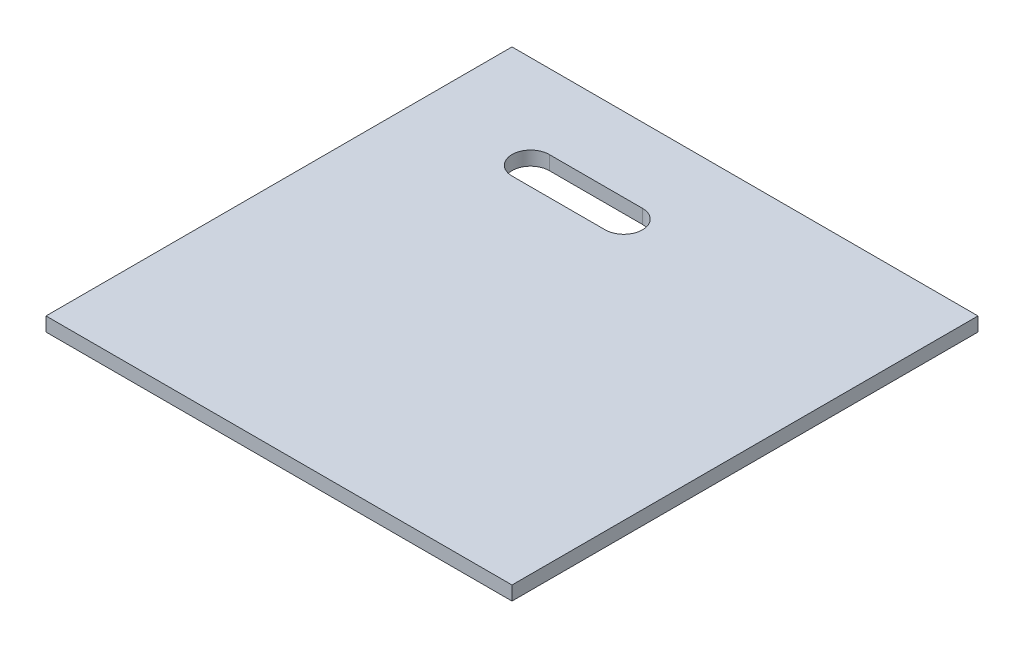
ISO-10303-21;
HEADER;
FILE_DESCRIPTION(('STEP AP214'),'2;1');
FILE_NAME('part.step','',(''),(''),'','','');
FILE_SCHEMA(('AUTOMOTIVE_DESIGN { 1 0 10303 214 1 1 1 1 }'));
ENDSEC;
DATA;
#1=APPLICATION_CONTEXT('core data for automotive mechanical design processes');
#2=APPLICATION_PROTOCOL_DEFINITION('international standard','automotive_design',2000,#1);
#3=PRODUCT_CONTEXT('',#1,'mechanical');
#4=PRODUCT('Part','Part','',(#3));
#5=PRODUCT_RELATED_PRODUCT_CATEGORY('part','',(#4));
#6=PRODUCT_DEFINITION_FORMATION('','',#4);
#7=PRODUCT_DEFINITION_CONTEXT('part definition',#1,'design');
#8=PRODUCT_DEFINITION('design','',#6,#7);
#9=PRODUCT_DEFINITION_SHAPE('','',#8);
#10=(LENGTH_UNIT() NAMED_UNIT(*) SI_UNIT(.MILLI.,.METRE.));
#11=(NAMED_UNIT(*) PLANE_ANGLE_UNIT() SI_UNIT($,.RADIAN.));
#12=(NAMED_UNIT(*) SI_UNIT($,.STERADIAN.) SOLID_ANGLE_UNIT());
#13=UNCERTAINTY_MEASURE_WITH_UNIT(LENGTH_MEASURE(1.E-05),#10,'distance_accuracy_value','');
#14=(GEOMETRIC_REPRESENTATION_CONTEXT(3) GLOBAL_UNCERTAINTY_ASSIGNED_CONTEXT((#13)) GLOBAL_UNIT_ASSIGNED_CONTEXT((#10,
#11,#12)) REPRESENTATION_CONTEXT('',''));
#15=CARTESIAN_POINT('',(0.,0.,0.));
#16=DIRECTION('',(0.,0.,1.));
#17=DIRECTION('',(1.,0.,0.));
#18=AXIS2_PLACEMENT_3D('',#15,#16,#17);
#19=CARTESIAN_POINT('',(250.,15.,250.));
#20=DIRECTION('',(-1.,0.,0.));
#21=DIRECTION('',(0.,0.,1.));
#22=AXIS2_PLACEMENT_3D('',#19,#20,#21);
#23=PLANE('',#22);
#24=DIRECTION('',(0.,0.,-1.));
#25=VECTOR('',#24,1.);
#26=CARTESIAN_POINT('',(250.,0.,250.));
#27=LINE('',#26,#25);
#28=CARTESIAN_POINT('',(250.,0.,250.));
#29=VERTEX_POINT('',#28);
#30=CARTESIAN_POINT('',(250.,0.,-250.));
#31=VERTEX_POINT('',#30);
#32=EDGE_CURVE('E128',#29,#31,#27,.T.);
#33=ORIENTED_EDGE('',*,*,#32,.T.);
#34=DIRECTION('',(0.,-1.,0.));
#35=VECTOR('',#34,1.);
#36=CARTESIAN_POINT('',(250.,15.,-250.));
#37=LINE('',#36,#35);
#38=CARTESIAN_POINT('',(250.,15.,-250.));
#39=VERTEX_POINT('',#38);
#40=EDGE_CURVE('E11',#39,#31,#37,.T.);
#41=ORIENTED_EDGE('',*,*,#40,.F.);
#42=DIRECTION('',(0.,0.,-1.));
#43=VECTOR('',#42,1.);
#44=CARTESIAN_POINT('',(250.,15.,250.));
#45=LINE('',#44,#43);
#46=CARTESIAN_POINT('',(250.,15.,250.));
#47=VERTEX_POINT('',#46);
#48=EDGE_CURVE('E132',#47,#39,#45,.T.);
#49=ORIENTED_EDGE('',*,*,#48,.F.);
#50=DIRECTION('',(0.,-1.,0.));
#51=VECTOR('',#50,1.);
#52=CARTESIAN_POINT('',(250.,15.,250.));
#53=LINE('',#52,#51);
#54=EDGE_CURVE('E142',#47,#29,#53,.T.);
#55=ORIENTED_EDGE('',*,*,#54,.T.);
#56=EDGE_LOOP('',(#33,#41,#49,#55));
#57=FACE_BOUND('',#56,.T.);
#58=ADVANCED_FACE('F31',(#57),#23,.F.);
#59=CARTESIAN_POINT('',(-250.,15.,-250.));
#60=DIRECTION('',(0.,0.,1.));
#61=DIRECTION('',(1.,0.,0.));
#62=AXIS2_PLACEMENT_3D('',#59,#60,#61);
#63=PLANE('',#62);
#64=DIRECTION('',(-1.,0.,0.));
#65=VECTOR('',#64,1.);
#66=CARTESIAN_POINT('',(-250.,0.,-250.));
#67=LINE('',#66,#65);
#68=CARTESIAN_POINT('',(-250.,0.,-250.));
#69=VERTEX_POINT('',#68);
#70=EDGE_CURVE('E145',#31,#69,#67,.T.);
#71=ORIENTED_EDGE('',*,*,#70,.T.);
#72=DIRECTION('',(0.,-1.,0.));
#73=VECTOR('',#72,1.);
#74=CARTESIAN_POINT('',(-250.,15.,-250.));
#75=LINE('',#74,#73);
#76=CARTESIAN_POINT('',(-250.,15.,-250.));
#77=VERTEX_POINT('',#76);
#78=EDGE_CURVE('E38',#77,#69,#75,.T.);
#79=ORIENTED_EDGE('',*,*,#78,.F.);
#80=DIRECTION('',(-1.,0.,0.));
#81=VECTOR('',#80,1.);
#82=CARTESIAN_POINT('',(-250.,15.,-250.));
#83=LINE('',#82,#81);
#84=EDGE_CURVE('E135',#39,#77,#83,.T.);
#85=ORIENTED_EDGE('',*,*,#84,.F.);
#86=ORIENTED_EDGE('',*,*,#40,.T.);
#87=EDGE_LOOP('',(#71,#79,#85,#86));
#88=FACE_BOUND('',#87,.T.);
#89=ADVANCED_FACE('F173',(#88),#63,.F.);
#90=CARTESIAN_POINT('',(-250.,15.,250.));
#91=DIRECTION('',(1.,0.,0.));
#92=DIRECTION('',(0.,0.,-1.));
#93=AXIS2_PLACEMENT_3D('',#90,#91,#92);
#94=PLANE('',#93);
#95=DIRECTION('',(0.,0.,1.));
#96=VECTOR('',#95,1.);
#97=CARTESIAN_POINT('',(-250.,0.,250.));
#98=LINE('',#97,#96);
#99=CARTESIAN_POINT('',(-250.,0.,250.));
#100=VERTEX_POINT('',#99);
#101=EDGE_CURVE('E147',#69,#100,#98,.T.);
#102=ORIENTED_EDGE('',*,*,#101,.T.);
#103=DIRECTION('',(0.,-1.,0.));
#104=VECTOR('',#103,1.);
#105=CARTESIAN_POINT('',(-250.,15.,250.));
#106=LINE('',#105,#104);
#107=CARTESIAN_POINT('',(-250.,15.,250.));
#108=VERTEX_POINT('',#107);
#109=EDGE_CURVE('E152',#108,#100,#106,.T.);
#110=ORIENTED_EDGE('',*,*,#109,.F.);
#111=DIRECTION('',(0.,0.,1.));
#112=VECTOR('',#111,1.);
#113=CARTESIAN_POINT('',(-250.,15.,250.));
#114=LINE('',#113,#112);
#115=EDGE_CURVE('E138',#77,#108,#114,.T.);
#116=ORIENTED_EDGE('',*,*,#115,.F.);
#117=ORIENTED_EDGE('',*,*,#78,.T.);
#118=EDGE_LOOP('',(#102,#110,#116,#117));
#119=FACE_BOUND('',#118,.T.);
#120=ADVANCED_FACE('F159',(#119),#94,.F.);
#121=CARTESIAN_POINT('',(-250.,15.,250.));
#122=DIRECTION('',(0.,0.,-1.));
#123=DIRECTION('',(-1.,0.,0.));
#124=AXIS2_PLACEMENT_3D('',#121,#122,#123);
#125=PLANE('',#124);
#126=DIRECTION('',(1.,0.,0.));
#127=VECTOR('',#126,1.);
#128=CARTESIAN_POINT('',(-250.,0.,250.));
#129=LINE('',#128,#127);
#130=EDGE_CURVE('E136',#100,#29,#129,.T.);
#131=ORIENTED_EDGE('',*,*,#130,.T.);
#132=ORIENTED_EDGE('',*,*,#54,.F.);
#133=DIRECTION('',(1.,0.,0.));
#134=VECTOR('',#133,1.);
#135=CARTESIAN_POINT('',(-250.,15.,250.));
#136=LINE('',#135,#134);
#137=EDGE_CURVE('E140',#108,#47,#136,.T.);
#138=ORIENTED_EDGE('',*,*,#137,.F.);
#139=ORIENTED_EDGE('',*,*,#109,.T.);
#140=EDGE_LOOP('',(#131,#132,#138,#139));
#141=FACE_BOUND('',#140,.T.);
#142=ADVANCED_FACE('F166',(#141),#125,.F.);
#143=CARTESIAN_POINT('',(250.,15.,-250.));
#144=DIRECTION('',(0.,-1.,0.));
#145=DIRECTION('',(0.,0.,-1.));
#146=AXIS2_PLACEMENT_3D('',#143,#144,#145);
#147=PLANE('',#146);
#148=DIRECTION('',(1.,0.,0.));
#149=VECTOR('',#148,1.);
#150=CARTESIAN_POINT('',(-130.,15.,-130.));
#151=LINE('',#150,#149);
#152=CARTESIAN_POINT('',(-130.,15.,-130.));
#153=VERTEX_POINT('',#152);
#154=CARTESIAN_POINT('',(-30.0000000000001,15.,-130.));
#155=VERTEX_POINT('',#154);
#156=EDGE_CURVE('E122',#153,#155,#151,.T.);
#157=ORIENTED_EDGE('',*,*,#156,.F.);
#158=CARTESIAN_POINT('',(-130.,15.,-150.));
#159=DIRECTION('',(0.,1.,0.));
#160=DIRECTION('',(0.,0.,-1.));
#161=AXIS2_PLACEMENT_3D('',#158,#159,#160);
#162=CIRCLE('',#161,20.);
#163=CARTESIAN_POINT('',(-130.,15.,-170.));
#164=VERTEX_POINT('',#163);
#165=EDGE_CURVE('E45',#164,#153,#162,.T.);
#166=ORIENTED_EDGE('',*,*,#165,.F.);
#167=DIRECTION('',(-1.,0.,0.));
#168=VECTOR('',#167,1.);
#169=CARTESIAN_POINT('',(-130.,15.,-170.));
#170=LINE('',#169,#168);
#171=CARTESIAN_POINT('',(-30.,15.,-170.));
#172=VERTEX_POINT('',#171);
#173=EDGE_CURVE('E113',#172,#164,#170,.T.);
#174=ORIENTED_EDGE('',*,*,#173,.F.);
#175=CARTESIAN_POINT('',(-30.0000000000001,15.,-150.));
#176=DIRECTION('',(0.,1.,0.));
#177=DIRECTION('',(0.,0.,1.));
#178=AXIS2_PLACEMENT_3D('',#175,#176,#177);
#179=CIRCLE('',#178,20.);
#180=EDGE_CURVE('E116',#155,#172,#179,.T.);
#181=ORIENTED_EDGE('',*,*,#180,.F.);
#182=EDGE_LOOP('',(#157,#166,#174,#181));
#183=FACE_BOUND('',#182,.T.);
#184=ORIENTED_EDGE('',*,*,#48,.T.);
#185=ORIENTED_EDGE('',*,*,#84,.T.);
#186=ORIENTED_EDGE('',*,*,#115,.T.);
#187=ORIENTED_EDGE('',*,*,#137,.T.);
#188=EDGE_LOOP('',(#184,#185,#186,#187));
#189=FACE_BOUND('',#188,.T.);
#190=ADVANCED_FACE('F172',(#183,#189),#147,.F.);
#191=CARTESIAN_POINT('',(250.,0.,-250.));
#192=DIRECTION('',(0.,-1.,0.));
#193=DIRECTION('',(0.,0.,-1.));
#194=AXIS2_PLACEMENT_3D('',#191,#192,#193);
#195=PLANE('',#194);
#196=CARTESIAN_POINT('',(-130.,0.,-150.));
#197=DIRECTION('',(0.,1.,0.));
#198=DIRECTION('',(0.,0.,-1.));
#199=AXIS2_PLACEMENT_3D('',#196,#197,#198);
#200=CIRCLE('',#199,20.);
#201=CARTESIAN_POINT('',(-130.,0.,-170.));
#202=VERTEX_POINT('',#201);
#203=CARTESIAN_POINT('',(-130.,0.,-130.));
#204=VERTEX_POINT('',#203);
#205=EDGE_CURVE('E97',#202,#204,#200,.T.);
#206=ORIENTED_EDGE('',*,*,#205,.T.);
#207=DIRECTION('',(1.,0.,0.));
#208=VECTOR('',#207,1.);
#209=CARTESIAN_POINT('',(-130.,0.,-130.));
#210=LINE('',#209,#208);
#211=CARTESIAN_POINT('',(-30.,0.,-130.));
#212=VERTEX_POINT('',#211);
#213=EDGE_CURVE('E106',#204,#212,#210,.T.);
#214=ORIENTED_EDGE('',*,*,#213,.T.);
#215=CARTESIAN_POINT('',(-30.0000000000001,0.,-150.));
#216=DIRECTION('',(0.,1.,0.));
#217=DIRECTION('',(0.,0.,1.));
#218=AXIS2_PLACEMENT_3D('',#215,#216,#217);
#219=CIRCLE('',#218,20.);
#220=CARTESIAN_POINT('',(-30.,0.,-170.));
#221=VERTEX_POINT('',#220);
#222=EDGE_CURVE('E53',#212,#221,#219,.T.);
#223=ORIENTED_EDGE('',*,*,#222,.T.);
#224=DIRECTION('',(-1.,0.,0.));
#225=VECTOR('',#224,1.);
#226=CARTESIAN_POINT('',(-130.,0.,-170.));
#227=LINE('',#226,#225);
#228=EDGE_CURVE('E103',#221,#202,#227,.T.);
#229=ORIENTED_EDGE('',*,*,#228,.T.);
#230=EDGE_LOOP('',(#206,#214,#223,#229));
#231=FACE_BOUND('',#230,.T.);
#232=ORIENTED_EDGE('',*,*,#32,.F.);
#233=ORIENTED_EDGE('',*,*,#130,.F.);
#234=ORIENTED_EDGE('',*,*,#101,.F.);
#235=ORIENTED_EDGE('',*,*,#70,.F.);
#236=EDGE_LOOP('',(#232,#233,#234,#235));
#237=FACE_BOUND('',#236,.T.);
#238=ADVANCED_FACE('F110',(#231,#237),#195,.T.);
#239=CARTESIAN_POINT('',(-130.,0.,-150.));
#240=DIRECTION('',(0.,1.,0.));
#241=DIRECTION('',(0.,0.,1.));
#242=AXIS2_PLACEMENT_3D('',#239,#240,#241);
#243=CYLINDRICAL_SURFACE('',#242,20.);
#244=ORIENTED_EDGE('',*,*,#165,.T.);
#245=DIRECTION('',(0.,1.,0.));
#246=VECTOR('',#245,1.);
#247=CARTESIAN_POINT('',(-130.,0.,-130.));
#248=LINE('',#247,#246);
#249=EDGE_CURVE('E93',#204,#153,#248,.T.);
#250=ORIENTED_EDGE('',*,*,#249,.F.);
#251=ORIENTED_EDGE('',*,*,#205,.F.);
#252=DIRECTION('',(0.,1.,0.));
#253=VECTOR('',#252,1.);
#254=CARTESIAN_POINT('',(-130.,0.,-170.));
#255=LINE('',#254,#253);
#256=EDGE_CURVE('E126',#202,#164,#255,.T.);
#257=ORIENTED_EDGE('',*,*,#256,.T.);
#258=EDGE_LOOP('',(#244,#250,#251,#257));
#259=FACE_BOUND('',#258,.T.);
#260=ADVANCED_FACE('F95',(#259),#243,.F.);
#261=CARTESIAN_POINT('',(-130.,0.,-170.));
#262=DIRECTION('',(0.,0.,-1.));
#263=DIRECTION('',(-1.,0.,0.));
#264=AXIS2_PLACEMENT_3D('',#261,#262,#263);
#265=PLANE('',#264);
#266=ORIENTED_EDGE('',*,*,#173,.T.);
#267=ORIENTED_EDGE('',*,*,#256,.F.);
#268=ORIENTED_EDGE('',*,*,#228,.F.);
#269=DIRECTION('',(0.,1.,0.));
#270=VECTOR('',#269,1.);
#271=CARTESIAN_POINT('',(-30.,0.,-170.));
#272=LINE('',#271,#270);
#273=EDGE_CURVE('E129',#221,#172,#272,.T.);
#274=ORIENTED_EDGE('',*,*,#273,.T.);
#275=EDGE_LOOP('',(#266,#267,#268,#274));
#276=FACE_BOUND('',#275,.T.);
#277=ADVANCED_FACE('F190',(#276),#265,.F.);
#278=CARTESIAN_POINT('',(-30.0000000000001,0.,-150.));
#279=DIRECTION('',(0.,1.,0.));
#280=DIRECTION('',(0.,0.,1.));
#281=AXIS2_PLACEMENT_3D('',#278,#279,#280);
#282=CYLINDRICAL_SURFACE('',#281,20.);
#283=ORIENTED_EDGE('',*,*,#180,.T.);
#284=ORIENTED_EDGE('',*,*,#273,.F.);
#285=ORIENTED_EDGE('',*,*,#222,.F.);
#286=DIRECTION('',(0.,1.,0.));
#287=VECTOR('',#286,1.);
#288=CARTESIAN_POINT('',(-30.0000000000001,0.,-130.));
#289=LINE('',#288,#287);
#290=EDGE_CURVE('E102',#212,#155,#289,.T.);
#291=ORIENTED_EDGE('',*,*,#290,.T.);
#292=EDGE_LOOP('',(#283,#284,#285,#291));
#293=FACE_BOUND('',#292,.T.);
#294=ADVANCED_FACE('F193',(#293),#282,.F.);
#295=CARTESIAN_POINT('',(-130.,0.,-130.));
#296=DIRECTION('',(0.,0.,1.));
#297=DIRECTION('',(1.,0.,0.));
#298=AXIS2_PLACEMENT_3D('',#295,#296,#297);
#299=PLANE('',#298);
#300=ORIENTED_EDGE('',*,*,#156,.T.);
#301=ORIENTED_EDGE('',*,*,#290,.F.);
#302=ORIENTED_EDGE('',*,*,#213,.F.);
#303=ORIENTED_EDGE('',*,*,#249,.T.);
#304=EDGE_LOOP('',(#300,#301,#302,#303));
#305=FACE_BOUND('',#304,.T.);
#306=ADVANCED_FACE('F107',(#305),#299,.F.);
#307=CLOSED_SHELL('',(#58,#89,#120,#142,#190,#238,#260,#277,#294,#306));
#308=MANIFOLD_SOLID_BREP('B2',#307);
#309=ADVANCED_BREP_SHAPE_REPRESENTATION('',(#18,#308),#14);
#310=SHAPE_DEFINITION_REPRESENTATION(#9,#309);
ENDSEC;
END-ISO-10303-21;
